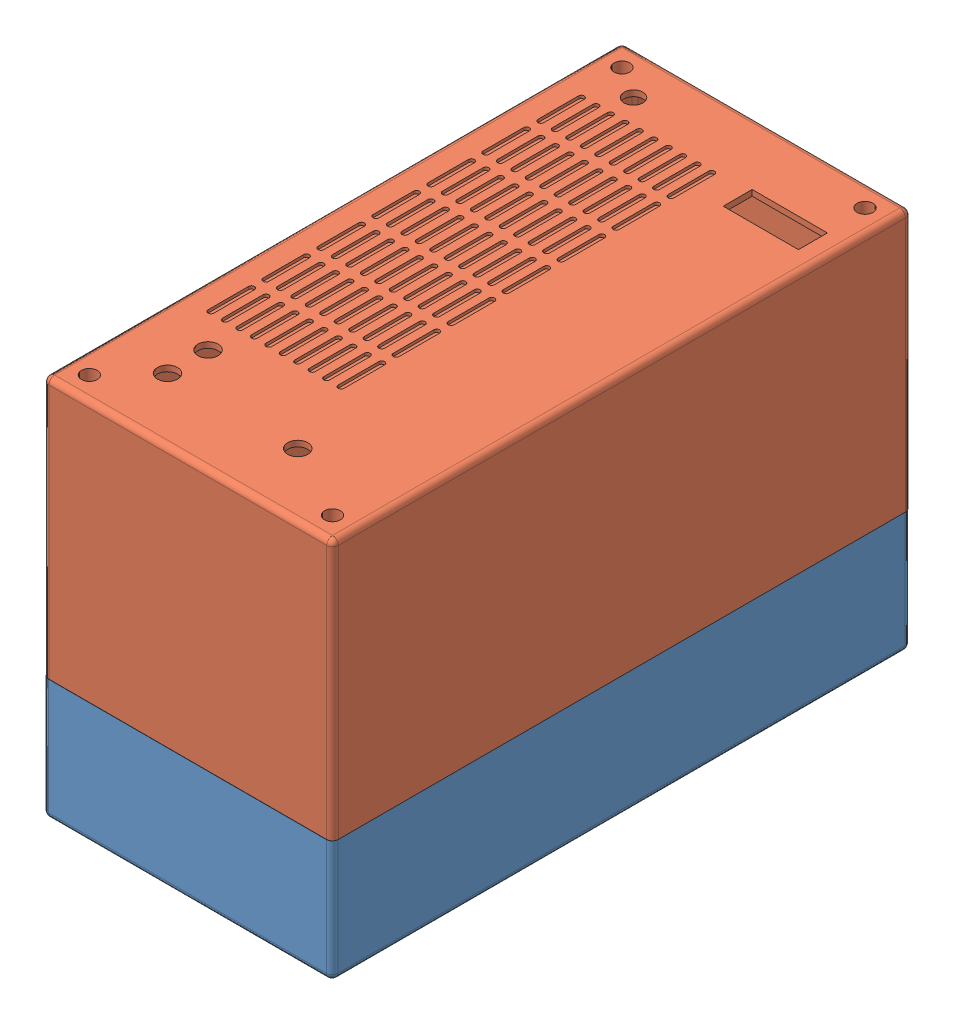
SolidWorks assembly Assem.SLDASM, configuration Default (file format 13000). Lengths in mm.
Overall size (100.06 132 200.08).
2 component instances, 2 part files, 1 mates.
Components (placement in the parent):
- Upper part-1: Upper part.SLDPRT [Default] at (77.6 71.2753 169.1712) size (100 42 200)
- Lower part-1: Lower part.SLDPRT [Default] at (77.6591 203.2753 169.0886) x (-1 0 0) z (0 0 1) size (100 95 200)
Mates (geometry in assembly coordinates):
- Coincident1: coincident anti-aligned: plane of Upper part-1 through (77.6 113.2753 169.1712) normal (0 1 0); plane of Lower part-1 through (77.6591 113.2753 169.0886) normal (0 -1 0)
